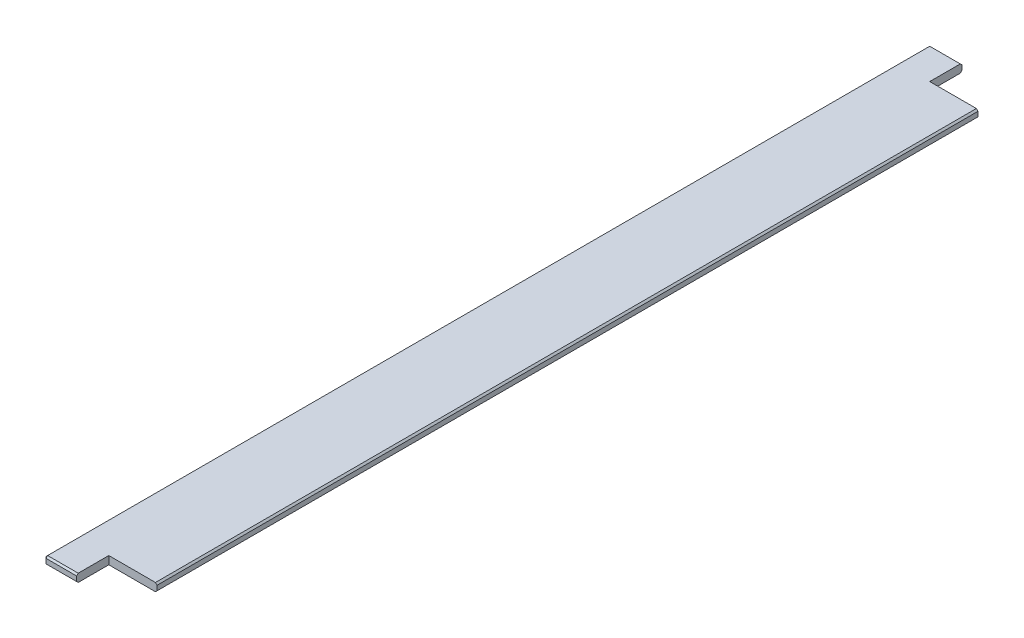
ISO-10303-21;
HEADER;
FILE_DESCRIPTION(('STEP AP214'),'2;1');
FILE_NAME('part.step','',(''),(''),'','','');
FILE_SCHEMA(('AUTOMOTIVE_DESIGN { 1 0 10303 214 1 1 1 1 }'));
ENDSEC;
DATA;
#1=APPLICATION_CONTEXT('core data for automotive mechanical design processes');
#2=APPLICATION_PROTOCOL_DEFINITION('international standard','automotive_design',2000,#1);
#3=PRODUCT_CONTEXT('',#1,'mechanical');
#4=PRODUCT('Part','Part','',(#3));
#5=PRODUCT_RELATED_PRODUCT_CATEGORY('part','',(#4));
#6=PRODUCT_DEFINITION_FORMATION('','',#4);
#7=PRODUCT_DEFINITION_CONTEXT('part definition',#1,'design');
#8=PRODUCT_DEFINITION('design','',#6,#7);
#9=PRODUCT_DEFINITION_SHAPE('','',#8);
#10=(LENGTH_UNIT() NAMED_UNIT(*) SI_UNIT(.MILLI.,.METRE.));
#11=(NAMED_UNIT(*) PLANE_ANGLE_UNIT() SI_UNIT($,.RADIAN.));
#12=(NAMED_UNIT(*) SI_UNIT($,.STERADIAN.) SOLID_ANGLE_UNIT());
#13=UNCERTAINTY_MEASURE_WITH_UNIT(LENGTH_MEASURE(1.E-05),#10,'distance_accuracy_value','');
#14=(GEOMETRIC_REPRESENTATION_CONTEXT(3) GLOBAL_UNCERTAINTY_ASSIGNED_CONTEXT((#13)) GLOBAL_UNIT_ASSIGNED_CONTEXT((#10,
#11,#12)) REPRESENTATION_CONTEXT('',''));
#15=CARTESIAN_POINT('',(0.,0.,0.));
#16=DIRECTION('',(0.,0.,1.));
#17=DIRECTION('',(1.,0.,0.));
#18=AXIS2_PLACEMENT_3D('',#15,#16,#17);
#19=CARTESIAN_POINT('',(50.,-4.99999999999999,550.));
#20=DIRECTION('',(-1.,0.,0.));
#21=DIRECTION('',(0.,0.,1.));
#22=AXIS2_PLACEMENT_3D('',#19,#20,#21);
#23=PLANE('',#22);
#24=DIRECTION('',(0.,0.,-1.));
#25=VECTOR('',#24,1.);
#26=CARTESIAN_POINT('',(50.,-2.99999999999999,550.));
#27=LINE('',#26,#25);
#28=CARTESIAN_POINT('',(50.,-2.99999999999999,510.));
#29=VERTEX_POINT('',#28);
#30=CARTESIAN_POINT('',(50.,-2.99999999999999,-510.));
#31=VERTEX_POINT('',#30);
#32=EDGE_CURVE('E216',#29,#31,#27,.T.);
#33=ORIENTED_EDGE('',*,*,#32,.T.);
#34=DIRECTION('',(0.,1.,0.));
#35=VECTOR('',#34,1.);
#36=CARTESIAN_POINT('',(50.,-5.00000000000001,-510.));
#37=LINE('',#36,#35);
#38=CARTESIAN_POINT('',(50.,2.9999999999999,-510.));
#39=VERTEX_POINT('',#38);
#40=EDGE_CURVE('E149',#31,#39,#37,.T.);
#41=ORIENTED_EDGE('',*,*,#40,.T.);
#42=DIRECTION('',(0.,0.,1.));
#43=VECTOR('',#42,1.);
#44=CARTESIAN_POINT('',(50.,2.9999999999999,550.));
#45=LINE('',#44,#43);
#46=CARTESIAN_POINT('',(50.,2.9999999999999,510.));
#47=VERTEX_POINT('',#46);
#48=EDGE_CURVE('E214',#39,#47,#45,.T.);
#49=ORIENTED_EDGE('',*,*,#48,.T.);
#50=DIRECTION('',(0.,1.,0.));
#51=VECTOR('',#50,1.);
#52=CARTESIAN_POINT('',(50.,-5.00000000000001,510.));
#53=LINE('',#52,#51);
#54=EDGE_CURVE('E180',#29,#47,#53,.T.);
#55=ORIENTED_EDGE('',*,*,#54,.F.);
#56=EDGE_LOOP('',(#33,#41,#49,#55));
#57=FACE_BOUND('',#56,.T.);
#58=ADVANCED_FACE('F30',(#57),#23,.F.);
#59=CARTESIAN_POINT('',(50.,5.00000000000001,550.));
#60=DIRECTION('',(0.,-1.,0.));
#61=DIRECTION('',(1.,0.,0.));
#62=AXIS2_PLACEMENT_3D('',#59,#60,#61);
#63=PLANE('',#62);
#64=DIRECTION('',(0.,0.,-1.));
#65=VECTOR('',#64,1.);
#66=CARTESIAN_POINT('',(48.,5.00000000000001,550.));
#67=LINE('',#66,#65);
#68=CARTESIAN_POINT('',(48.,5.00000000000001,510.));
#69=VERTEX_POINT('',#68);
#70=CARTESIAN_POINT('',(48.,5.00000000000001,-510.));
#71=VERTEX_POINT('',#70);
#72=EDGE_CURVE('E239',#69,#71,#67,.T.);
#73=ORIENTED_EDGE('',*,*,#72,.T.);
#74=DIRECTION('',(1.,0.,0.));
#75=VECTOR('',#74,1.);
#76=CARTESIAN_POINT('',(50.,5.00000000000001,-510.));
#77=LINE('',#76,#75);
#78=CARTESIAN_POINT('',(-9.99999999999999,5.,-510.));
#79=VERTEX_POINT('',#78);
#80=EDGE_CURVE('E161',#79,#71,#77,.T.);
#81=ORIENTED_EDGE('',*,*,#80,.F.);
#82=DIRECTION('',(0.,0.,1.));
#83=VECTOR('',#82,1.);
#84=CARTESIAN_POINT('',(-9.99999999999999,5.,-510.));
#85=LINE('',#84,#83);
#86=CARTESIAN_POINT('',(-9.99999999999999,5.,-548.));
#87=VERTEX_POINT('',#86);
#88=EDGE_CURVE('E146',#87,#79,#85,.T.);
#89=ORIENTED_EDGE('',*,*,#88,.F.);
#90=DIRECTION('',(-1.,0.,0.));
#91=VECTOR('',#90,1.);
#92=CARTESIAN_POINT('',(50.,5.00000000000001,-548.));
#93=LINE('',#92,#91);
#94=CARTESIAN_POINT('',(-48.,4.99999999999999,-548.));
#95=VERTEX_POINT('',#94);
#96=EDGE_CURVE('E232',#87,#95,#93,.T.);
#97=ORIENTED_EDGE('',*,*,#96,.T.);
#98=DIRECTION('',(0.,0.,1.));
#99=VECTOR('',#98,1.);
#100=CARTESIAN_POINT('',(-48.,4.99999999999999,550.));
#101=LINE('',#100,#99);
#102=CARTESIAN_POINT('',(-48.,4.99999999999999,548.));
#103=VERTEX_POINT('',#102);
#104=EDGE_CURVE('E234',#95,#103,#101,.T.);
#105=ORIENTED_EDGE('',*,*,#104,.T.);
#106=DIRECTION('',(1.,0.,0.));
#107=VECTOR('',#106,1.);
#108=CARTESIAN_POINT('',(50.,5.00000000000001,548.));
#109=LINE('',#108,#107);
#110=CARTESIAN_POINT('',(-9.99999999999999,5.,548.));
#111=VERTEX_POINT('',#110);
#112=EDGE_CURVE('E236',#103,#111,#109,.T.);
#113=ORIENTED_EDGE('',*,*,#112,.T.);
#114=DIRECTION('',(0.,0.,1.));
#115=VECTOR('',#114,1.);
#116=CARTESIAN_POINT('',(-9.99999999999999,5.,510.));
#117=LINE('',#116,#115);
#118=CARTESIAN_POINT('',(-9.99999999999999,5.,510.));
#119=VERTEX_POINT('',#118);
#120=EDGE_CURVE('E177',#119,#111,#117,.T.);
#121=ORIENTED_EDGE('',*,*,#120,.F.);
#122=DIRECTION('',(-1.,0.,0.));
#123=VECTOR('',#122,1.);
#124=CARTESIAN_POINT('',(50.,5.00000000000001,510.));
#125=LINE('',#124,#123);
#126=EDGE_CURVE('E173',#69,#119,#125,.T.);
#127=ORIENTED_EDGE('',*,*,#126,.F.);
#128=EDGE_LOOP('',(#73,#81,#89,#97,#105,#113,#121,#127));
#129=FACE_BOUND('',#128,.T.);
#130=ADVANCED_FACE('F315',(#129),#63,.F.);
#131=CARTESIAN_POINT('',(-50.,-5.00000000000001,550.));
#132=DIRECTION('',(1.,0.,0.));
#133=DIRECTION('',(0.,0.,-1.));
#134=AXIS2_PLACEMENT_3D('',#131,#132,#133);
#135=PLANE('',#134);
#136=DIRECTION('',(0.,0.,-1.));
#137=VECTOR('',#136,1.);
#138=CARTESIAN_POINT('',(-50.,2.99999999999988,550.));
#139=LINE('',#138,#137);
#140=CARTESIAN_POINT('',(-50.,2.99999999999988,548.));
#141=VERTEX_POINT('',#140);
#142=CARTESIAN_POINT('',(-50.,2.99999999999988,-548.));
#143=VERTEX_POINT('',#142);
#144=EDGE_CURVE('E196',#141,#143,#139,.T.);
#145=ORIENTED_EDGE('',*,*,#144,.T.);
#146=DIRECTION('',(0.,-1.,0.));
#147=VECTOR('',#146,1.);
#148=CARTESIAN_POINT('',(-50.,-5.00000000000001,-548.));
#149=LINE('',#148,#147);
#150=CARTESIAN_POINT('',(-50.,-2.99999999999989,-548.));
#151=VERTEX_POINT('',#150);
#152=EDGE_CURVE('E203',#143,#151,#149,.T.);
#153=ORIENTED_EDGE('',*,*,#152,.T.);
#154=DIRECTION('',(0.,0.,1.));
#155=VECTOR('',#154,1.);
#156=CARTESIAN_POINT('',(-50.,-2.99999999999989,550.));
#157=LINE('',#156,#155);
#158=CARTESIAN_POINT('',(-50.,-2.99999999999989,548.));
#159=VERTEX_POINT('',#158);
#160=EDGE_CURVE('E201',#151,#159,#157,.T.);
#161=ORIENTED_EDGE('',*,*,#160,.T.);
#162=DIRECTION('',(0.,1.,0.));
#163=VECTOR('',#162,1.);
#164=CARTESIAN_POINT('',(-50.,4.99999999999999,548.));
#165=LINE('',#164,#163);
#166=EDGE_CURVE('E198',#159,#141,#165,.T.);
#167=ORIENTED_EDGE('',*,*,#166,.T.);
#168=EDGE_LOOP('',(#145,#153,#161,#167));
#169=FACE_BOUND('',#168,.T.);
#170=ADVANCED_FACE('F301',(#169),#135,.F.);
#171=CARTESIAN_POINT('',(50.,-4.99999999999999,550.));
#172=DIRECTION('',(0.,1.,0.));
#173=DIRECTION('',(-1.,0.,0.));
#174=AXIS2_PLACEMENT_3D('',#171,#172,#173);
#175=PLANE('',#174);
#176=DIRECTION('',(0.,0.,1.));
#177=VECTOR('',#176,1.);
#178=CARTESIAN_POINT('',(-9.99999999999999,-5.00000000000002,-510.));
#179=LINE('',#178,#177);
#180=CARTESIAN_POINT('',(-9.99999999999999,-5.,-548.));
#181=VERTEX_POINT('',#180);
#182=CARTESIAN_POINT('',(-9.99999999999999,-5.00000000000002,-510.));
#183=VERTEX_POINT('',#182);
#184=EDGE_CURVE('E45',#181,#183,#179,.T.);
#185=ORIENTED_EDGE('',*,*,#184,.T.);
#186=DIRECTION('',(1.,0.,0.));
#187=VECTOR('',#186,1.);
#188=CARTESIAN_POINT('',(50.,-5.00000000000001,-510.));
#189=LINE('',#188,#187);
#190=CARTESIAN_POINT('',(47.9999999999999,-5.00000000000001,-510.));
#191=VERTEX_POINT('',#190);
#192=EDGE_CURVE('E152',#183,#191,#189,.T.);
#193=ORIENTED_EDGE('',*,*,#192,.T.);
#194=DIRECTION('',(0.,0.,1.));
#195=VECTOR('',#194,1.);
#196=CARTESIAN_POINT('',(47.9999999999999,-4.99999999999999,550.));
#197=LINE('',#196,#195);
#198=CARTESIAN_POINT('',(47.9999999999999,-4.99999999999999,510.));
#199=VERTEX_POINT('',#198);
#200=EDGE_CURVE('E53',#191,#199,#197,.T.);
#201=ORIENTED_EDGE('',*,*,#200,.T.);
#202=DIRECTION('',(-1.,0.,0.));
#203=VECTOR('',#202,1.);
#204=CARTESIAN_POINT('',(50.,-5.00000000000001,510.));
#205=LINE('',#204,#203);
#206=CARTESIAN_POINT('',(-9.99999999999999,-5.00000000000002,510.));
#207=VERTEX_POINT('',#206);
#208=EDGE_CURVE('E174',#199,#207,#205,.T.);
#209=ORIENTED_EDGE('',*,*,#208,.T.);
#210=DIRECTION('',(0.,0.,1.));
#211=VECTOR('',#210,1.);
#212=CARTESIAN_POINT('',(-9.99999999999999,-5.00000000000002,510.));
#213=LINE('',#212,#211);
#214=CARTESIAN_POINT('',(-9.99999999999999,-5.00000000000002,548.));
#215=VERTEX_POINT('',#214);
#216=EDGE_CURVE('E176',#207,#215,#213,.T.);
#217=ORIENTED_EDGE('',*,*,#216,.T.);
#218=DIRECTION('',(-1.,0.,0.));
#219=VECTOR('',#218,1.);
#220=CARTESIAN_POINT('',(-50.,-5.00000000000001,548.));
#221=LINE('',#220,#219);
#222=CARTESIAN_POINT('',(-48.,-5.00000000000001,548.));
#223=VERTEX_POINT('',#222);
#224=EDGE_CURVE('E219',#215,#223,#221,.T.);
#225=ORIENTED_EDGE('',*,*,#224,.T.);
#226=DIRECTION('',(0.,0.,-1.));
#227=VECTOR('',#226,1.);
#228=CARTESIAN_POINT('',(-48.,-5.00000000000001,550.));
#229=LINE('',#228,#227);
#230=CARTESIAN_POINT('',(-48.,-5.00000000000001,-548.));
#231=VERTEX_POINT('',#230);
#232=EDGE_CURVE('E223',#223,#231,#229,.T.);
#233=ORIENTED_EDGE('',*,*,#232,.T.);
#234=DIRECTION('',(1.,0.,0.));
#235=VECTOR('',#234,1.);
#236=CARTESIAN_POINT('',(50.,-4.99999999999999,-548.));
#237=LINE('',#236,#235);
#238=EDGE_CURVE('E160',#231,#181,#237,.T.);
#239=ORIENTED_EDGE('',*,*,#238,.T.);
#240=EDGE_LOOP('',(#185,#193,#201,#209,#217,#225,#233,#239));
#241=FACE_BOUND('',#240,.T.);
#242=ADVANCED_FACE('F157',(#241),#175,.F.);
#243=CARTESIAN_POINT('',(50.,5.00000000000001,550.));
#244=DIRECTION('',(0.,0.,1.));
#245=DIRECTION('',(1.,0.,0.));
#246=AXIS2_PLACEMENT_3D('',#243,#244,#245);
#247=PLANE('',#246);
#248=DIRECTION('',(0.,1.,0.));
#249=VECTOR('',#248,1.);
#250=CARTESIAN_POINT('',(-9.99999999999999,-5.00000000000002,550.));
#251=LINE('',#250,#249);
#252=CARTESIAN_POINT('',(-9.99999999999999,-2.99999999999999,550.));
#253=VERTEX_POINT('',#252);
#254=CARTESIAN_POINT('',(-9.99999999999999,2.99999999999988,550.));
#255=VERTEX_POINT('',#254);
#256=EDGE_CURVE('E183',#253,#255,#251,.T.);
#257=ORIENTED_EDGE('',*,*,#256,.T.);
#258=DIRECTION('',(-1.,0.,0.));
#259=VECTOR('',#258,1.);
#260=CARTESIAN_POINT('',(-50.,2.99999999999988,550.));
#261=LINE('',#260,#259);
#262=CARTESIAN_POINT('',(-48.,2.99999999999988,550.));
#263=VERTEX_POINT('',#262);
#264=EDGE_CURVE('E225',#255,#263,#261,.T.);
#265=ORIENTED_EDGE('',*,*,#264,.T.);
#266=DIRECTION('',(0.,-1.,0.));
#267=VECTOR('',#266,1.);
#268=CARTESIAN_POINT('',(-48.,-5.00000000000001,550.));
#269=LINE('',#268,#267);
#270=CARTESIAN_POINT('',(-48.,-3.,550.));
#271=VERTEX_POINT('',#270);
#272=EDGE_CURVE('E227',#263,#271,#269,.T.);
#273=ORIENTED_EDGE('',*,*,#272,.T.);
#274=DIRECTION('',(1.,0.,0.));
#275=VECTOR('',#274,1.);
#276=CARTESIAN_POINT('',(50.,-2.99999999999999,550.));
#277=LINE('',#276,#275);
#278=EDGE_CURVE('E229',#271,#253,#277,.T.);
#279=ORIENTED_EDGE('',*,*,#278,.T.);
#280=EDGE_LOOP('',(#257,#265,#273,#279));
#281=FACE_BOUND('',#280,.T.);
#282=ADVANCED_FACE('F389',(#281),#247,.T.);
#283=CARTESIAN_POINT('',(50.,5.00000000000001,-550.));
#284=DIRECTION('',(0.,0.,1.));
#285=DIRECTION('',(1.,0.,0.));
#286=AXIS2_PLACEMENT_3D('',#283,#284,#285);
#287=PLANE('',#286);
#288=DIRECTION('',(1.,0.,0.));
#289=VECTOR('',#288,1.);
#290=CARTESIAN_POINT('',(50.,2.99999999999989,-550.));
#291=LINE('',#290,#289);
#292=CARTESIAN_POINT('',(-47.9999999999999,2.99999999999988,-550.));
#293=VERTEX_POINT('',#292);
#294=CARTESIAN_POINT('',(-9.99999999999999,2.99999999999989,-550.));
#295=VERTEX_POINT('',#294);
#296=EDGE_CURVE('E206',#293,#295,#291,.T.);
#297=ORIENTED_EDGE('',*,*,#296,.T.);
#298=DIRECTION('',(0.,1.,0.));
#299=VECTOR('',#298,1.);
#300=CARTESIAN_POINT('',(-9.99999999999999,-5.00000000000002,-550.));
#301=LINE('',#300,#299);
#302=CARTESIAN_POINT('',(-9.99999999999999,-2.99999999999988,-550.));
#303=VERTEX_POINT('',#302);
#304=EDGE_CURVE('E150',#303,#295,#301,.T.);
#305=ORIENTED_EDGE('',*,*,#304,.F.);
#306=DIRECTION('',(-1.,0.,0.));
#307=VECTOR('',#306,1.);
#308=CARTESIAN_POINT('',(50.,-2.99999999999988,-550.));
#309=LINE('',#308,#307);
#310=CARTESIAN_POINT('',(-47.9999999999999,-2.99999999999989,-550.));
#311=VERTEX_POINT('',#310);
#312=EDGE_CURVE('E212',#303,#311,#309,.T.);
#313=ORIENTED_EDGE('',*,*,#312,.T.);
#314=DIRECTION('',(0.,1.,0.));
#315=VECTOR('',#314,1.);
#316=CARTESIAN_POINT('',(-47.9999999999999,5.00000000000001,-550.));
#317=LINE('',#316,#315);
#318=EDGE_CURVE('E209',#311,#293,#317,.T.);
#319=ORIENTED_EDGE('',*,*,#318,.T.);
#320=EDGE_LOOP('',(#297,#305,#313,#319));
#321=FACE_BOUND('',#320,.T.);
#322=ADVANCED_FACE('F281',(#321),#287,.F.);
#323=CARTESIAN_POINT('',(48.,5.00000000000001,550.));
#324=DIRECTION('',(-0.707106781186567,-0.707106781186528,0.));
#325=DIRECTION('',(0.707106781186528,-0.707106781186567,0.));
#326=AXIS2_PLACEMENT_3D('',#323,#324,#325);
#327=PLANE('',#326);
#328=DIRECTION('',(-0.707106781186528,0.707106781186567,0.));
#329=VECTOR('',#328,1.);
#330=CARTESIAN_POINT('',(48.,5.00000000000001,-510.));
#331=LINE('',#330,#329);
#332=EDGE_CURVE('E171',#71,#39,#331,.F.);
#333=ORIENTED_EDGE('',*,*,#332,.F.);
#334=ORIENTED_EDGE('',*,*,#72,.F.);
#335=DIRECTION('',(0.707106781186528,-0.707106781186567,0.));
#336=VECTOR('',#335,1.);
#337=CARTESIAN_POINT('',(48.,5.00000000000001,510.));
#338=LINE('',#337,#336);
#339=EDGE_CURVE('E186',#47,#69,#338,.F.);
#340=ORIENTED_EDGE('',*,*,#339,.F.);
#341=ORIENTED_EDGE('',*,*,#48,.F.);
#342=EDGE_LOOP('',(#333,#334,#340,#341));
#343=FACE_BOUND('',#342,.T.);
#344=ADVANCED_FACE('F32',(#343),#327,.F.);
#345=CARTESIAN_POINT('',(50.,2.9999999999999,550.));
#346=DIRECTION('',(0.,0.707106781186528,0.707106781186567));
#347=DIRECTION('',(0.,-0.707106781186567,0.707106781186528));
#348=AXIS2_PLACEMENT_3D('',#345,#346,#347);
#349=PLANE('',#348);
#350=DIRECTION('',(0.,-0.707106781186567,0.707106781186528));
#351=VECTOR('',#350,1.);
#352=CARTESIAN_POINT('',(-9.99999999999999,2.99999999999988,550.));
#353=LINE('',#352,#351);
#354=EDGE_CURVE('E193',#111,#255,#353,.T.);
#355=ORIENTED_EDGE('',*,*,#354,.F.);
#356=ORIENTED_EDGE('',*,*,#112,.F.);
#357=DIRECTION('',(0.,0.707106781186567,-0.707106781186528));
#358=VECTOR('',#357,1.);
#359=CARTESIAN_POINT('',(-48.,3.99999999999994,549.));
#360=LINE('',#359,#358);
#361=EDGE_CURVE('E199',#263,#103,#360,.T.);
#362=ORIENTED_EDGE('',*,*,#361,.F.);
#363=ORIENTED_EDGE('',*,*,#264,.F.);
#364=EDGE_LOOP('',(#355,#356,#362,#363));
#365=FACE_BOUND('',#364,.T.);
#366=ADVANCED_FACE('F385',(#365),#349,.T.);
#367=CARTESIAN_POINT('',(-48.,5.00000000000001,550.));
#368=DIRECTION('',(-0.707106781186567,0.,0.707106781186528));
#369=DIRECTION('',(0.707106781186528,0.,0.707106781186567));
#370=AXIS2_PLACEMENT_3D('',#367,#368,#369);
#371=PLANE('',#370);
#372=DIRECTION('',(-0.707106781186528,0.,-0.707106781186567));
#373=VECTOR('',#372,1.);
#374=CARTESIAN_POINT('',(-50.,-2.99999999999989,548.));
#375=LINE('',#374,#373);
#376=EDGE_CURVE('E266',#271,#159,#375,.T.);
#377=ORIENTED_EDGE('',*,*,#376,.F.);
#378=ORIENTED_EDGE('',*,*,#272,.F.);
#379=DIRECTION('',(0.707106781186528,0.,0.707106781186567));
#380=VECTOR('',#379,1.);
#381=CARTESIAN_POINT('',(-50.,2.99999999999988,548.));
#382=LINE('',#381,#380);
#383=EDGE_CURVE('E269',#141,#263,#382,.T.);
#384=ORIENTED_EDGE('',*,*,#383,.F.);
#385=ORIENTED_EDGE('',*,*,#166,.F.);
#386=EDGE_LOOP('',(#377,#378,#384,#385));
#387=FACE_BOUND('',#386,.T.);
#388=ADVANCED_FACE('F341',(#387),#371,.T.);
#389=CARTESIAN_POINT('',(50.,-2.99999999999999,550.));
#390=DIRECTION('',(0.,-0.707106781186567,0.707106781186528));
#391=DIRECTION('',(0.,-0.707106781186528,-0.707106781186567));
#392=AXIS2_PLACEMENT_3D('',#389,#390,#391);
#393=PLANE('',#392);
#394=DIRECTION('',(0.,-0.707106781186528,-0.707106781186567));
#395=VECTOR('',#394,1.);
#396=CARTESIAN_POINT('',(-9.99999999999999,-2.99999999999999,550.));
#397=LINE('',#396,#395);
#398=EDGE_CURVE('E275',#253,#215,#397,.T.);
#399=ORIENTED_EDGE('',*,*,#398,.F.);
#400=ORIENTED_EDGE('',*,*,#278,.F.);
#401=DIRECTION('',(0.,0.707106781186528,0.707106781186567));
#402=VECTOR('',#401,1.);
#403=CARTESIAN_POINT('',(-48.,-4.00000000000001,549.));
#404=LINE('',#403,#402);
#405=EDGE_CURVE('E263',#223,#271,#404,.T.);
#406=ORIENTED_EDGE('',*,*,#405,.F.);
#407=ORIENTED_EDGE('',*,*,#224,.F.);
#408=EDGE_LOOP('',(#399,#400,#406,#407));
#409=FACE_BOUND('',#408,.T.);
#410=ADVANCED_FACE('F332',(#409),#393,.T.);
#411=CARTESIAN_POINT('',(50.,-2.99999999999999,550.));
#412=DIRECTION('',(-0.707106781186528,0.707106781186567,0.));
#413=DIRECTION('',(-0.707106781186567,-0.707106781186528,0.));
#414=AXIS2_PLACEMENT_3D('',#411,#412,#413);
#415=PLANE('',#414);
#416=DIRECTION('',(0.707106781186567,0.707106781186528,0.));
#417=VECTOR('',#416,1.);
#418=CARTESIAN_POINT('',(50.,-2.99999999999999,-510.));
#419=LINE('',#418,#417);
#420=EDGE_CURVE('E11',#31,#191,#419,.F.);
#421=ORIENTED_EDGE('',*,*,#420,.F.);
#422=ORIENTED_EDGE('',*,*,#32,.F.);
#423=DIRECTION('',(-0.707106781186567,-0.707106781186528,0.));
#424=VECTOR('',#423,1.);
#425=CARTESIAN_POINT('',(50.,-2.99999999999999,510.));
#426=LINE('',#425,#424);
#427=EDGE_CURVE('E242',#199,#29,#426,.F.);
#428=ORIENTED_EDGE('',*,*,#427,.F.);
#429=ORIENTED_EDGE('',*,*,#200,.F.);
#430=EDGE_LOOP('',(#421,#422,#428,#429));
#431=FACE_BOUND('',#430,.T.);
#432=ADVANCED_FACE('F329',(#431),#415,.F.);
#433=CARTESIAN_POINT('',(-50.,2.99999999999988,548.));
#434=DIRECTION('',(-0.577350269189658,0.577350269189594,0.577350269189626));
#435=DIRECTION('',(0.707106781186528,0.,0.707106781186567));
#436=AXIS2_PLACEMENT_3D('',#433,#434,#435);
#437=PLANE('',#436);
#438=ORIENTED_EDGE('',*,*,#383,.T.);
#439=ORIENTED_EDGE('',*,*,#361,.T.);
#440=DIRECTION('',(0.707106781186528,0.707106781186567,0.));
#441=VECTOR('',#440,1.);
#442=CARTESIAN_POINT('',(-50.,2.99999999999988,548.));
#443=LINE('',#442,#441);
#444=EDGE_CURVE('E260',#141,#103,#443,.T.);
#445=ORIENTED_EDGE('',*,*,#444,.F.);
#446=EDGE_LOOP('',(#438,#439,#445));
#447=FACE_BOUND('',#446,.T.);
#448=ADVANCED_FACE('F331',(#447),#437,.T.);
#449=CARTESIAN_POINT('',(-50.,-2.99999999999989,548.));
#450=DIRECTION('',(-0.577350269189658,-0.577350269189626,0.577350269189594));
#451=DIRECTION('',(0.707106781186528,-0.707106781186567,0.));
#452=AXIS2_PLACEMENT_3D('',#449,#450,#451);
#453=PLANE('',#452);
#454=ORIENTED_EDGE('',*,*,#405,.T.);
#455=ORIENTED_EDGE('',*,*,#376,.T.);
#456=DIRECTION('',(-0.707106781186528,0.707106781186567,0.));
#457=VECTOR('',#456,1.);
#458=CARTESIAN_POINT('',(-50.,-2.99999999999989,548.));
#459=LINE('',#458,#457);
#460=EDGE_CURVE('E257',#223,#159,#459,.T.);
#461=ORIENTED_EDGE('',*,*,#460,.F.);
#462=EDGE_LOOP('',(#454,#455,#461));
#463=FACE_BOUND('',#462,.T.);
#464=ADVANCED_FACE('F338',(#463),#453,.T.);
#465=CARTESIAN_POINT('',(50.,5.00000000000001,-548.));
#466=DIRECTION('',(0.,-0.707106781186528,0.707106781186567));
#467=DIRECTION('',(0.,-0.707106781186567,-0.707106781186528));
#468=AXIS2_PLACEMENT_3D('',#465,#466,#467);
#469=PLANE('',#468);
#470=DIRECTION('',(0.,-0.707106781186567,-0.707106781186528));
#471=VECTOR('',#470,1.);
#472=CARTESIAN_POINT('',(-9.99999999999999,5.,-548.));
#473=LINE('',#472,#471);
#474=EDGE_CURVE('E167',#295,#87,#473,.F.);
#475=ORIENTED_EDGE('',*,*,#474,.F.);
#476=ORIENTED_EDGE('',*,*,#296,.F.);
#477=DIRECTION('',(0.,0.707106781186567,0.707106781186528));
#478=VECTOR('',#477,1.);
#479=CARTESIAN_POINT('',(-47.9999999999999,2.99999999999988,-550.));
#480=LINE('',#479,#478);
#481=EDGE_CURVE('E254',#95,#293,#480,.F.);
#482=ORIENTED_EDGE('',*,*,#481,.F.);
#483=ORIENTED_EDGE('',*,*,#96,.F.);
#484=EDGE_LOOP('',(#475,#476,#482,#483));
#485=FACE_BOUND('',#484,.T.);
#486=ADVANCED_FACE('F313',(#485),#469,.F.);
#487=CARTESIAN_POINT('',(-50.,2.99999999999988,550.));
#488=DIRECTION('',(0.707106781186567,-0.707106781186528,0.));
#489=DIRECTION('',(0.707106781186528,0.707106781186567,0.));
#490=AXIS2_PLACEMENT_3D('',#487,#488,#489);
#491=PLANE('',#490);
#492=ORIENTED_EDGE('',*,*,#444,.T.);
#493=ORIENTED_EDGE('',*,*,#104,.F.);
#494=DIRECTION('',(-0.707106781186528,-0.707106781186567,0.));
#495=VECTOR('',#494,1.);
#496=CARTESIAN_POINT('',(-49.,3.99999999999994,-548.));
#497=LINE('',#496,#495);
#498=EDGE_CURVE('E251',#143,#95,#497,.F.);
#499=ORIENTED_EDGE('',*,*,#498,.F.);
#500=ORIENTED_EDGE('',*,*,#144,.F.);
#501=EDGE_LOOP('',(#492,#493,#499,#500));
#502=FACE_BOUND('',#501,.T.);
#503=ADVANCED_FACE('F307',(#502),#491,.F.);
#504=CARTESIAN_POINT('',(-48.,-5.00000000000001,550.));
#505=DIRECTION('',(0.707106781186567,0.707106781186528,0.));
#506=DIRECTION('',(-0.707106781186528,0.707106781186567,0.));
#507=AXIS2_PLACEMENT_3D('',#504,#505,#506);
#508=PLANE('',#507);
#509=ORIENTED_EDGE('',*,*,#460,.T.);
#510=ORIENTED_EDGE('',*,*,#160,.F.);
#511=DIRECTION('',(0.707106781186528,-0.707106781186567,0.));
#512=VECTOR('',#511,1.);
#513=CARTESIAN_POINT('',(-50.,-2.99999999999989,-548.));
#514=LINE('',#513,#512);
#515=EDGE_CURVE('E248',#231,#151,#514,.F.);
#516=ORIENTED_EDGE('',*,*,#515,.F.);
#517=ORIENTED_EDGE('',*,*,#232,.F.);
#518=EDGE_LOOP('',(#509,#510,#516,#517));
#519=FACE_BOUND('',#518,.T.);
#520=ADVANCED_FACE('F297',(#519),#508,.F.);
#521=CARTESIAN_POINT('',(50.,-4.99999999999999,-548.));
#522=DIRECTION('',(0.,0.707106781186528,0.707106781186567));
#523=DIRECTION('',(0.,-0.707106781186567,0.707106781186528));
#524=AXIS2_PLACEMENT_3D('',#521,#522,#523);
#525=PLANE('',#524);
#526=DIRECTION('',(0.,-0.707106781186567,0.707106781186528));
#527=VECTOR('',#526,1.);
#528=CARTESIAN_POINT('',(-9.99999999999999,-5.,-548.));
#529=LINE('',#528,#527);
#530=EDGE_CURVE('E38',#181,#303,#529,.F.);
#531=ORIENTED_EDGE('',*,*,#530,.F.);
#532=ORIENTED_EDGE('',*,*,#238,.F.);
#533=DIRECTION('',(0.,0.707106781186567,-0.707106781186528));
#534=VECTOR('',#533,1.);
#535=CARTESIAN_POINT('',(-47.9999999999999,-3.99999999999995,-549.));
#536=LINE('',#535,#534);
#537=EDGE_CURVE('E246',#311,#231,#536,.F.);
#538=ORIENTED_EDGE('',*,*,#537,.F.);
#539=ORIENTED_EDGE('',*,*,#312,.F.);
#540=EDGE_LOOP('',(#531,#532,#538,#539));
#541=FACE_BOUND('',#540,.T.);
#542=ADVANCED_FACE('F284',(#541),#525,.F.);
#543=CARTESIAN_POINT('',(-47.9999999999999,2.99999999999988,-550.));
#544=DIRECTION('',(-0.577350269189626,0.577350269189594,-0.577350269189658));
#545=DIRECTION('',(-0.707106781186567,0.,0.707106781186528));
#546=AXIS2_PLACEMENT_3D('',#543,#544,#545);
#547=PLANE('',#546);
#548=ORIENTED_EDGE('',*,*,#498,.T.);
#549=ORIENTED_EDGE('',*,*,#481,.T.);
#550=DIRECTION('',(0.707106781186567,0.,-0.707106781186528));
#551=VECTOR('',#550,1.);
#552=CARTESIAN_POINT('',(-47.9999999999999,2.99999999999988,-550.));
#553=LINE('',#552,#551);
#554=EDGE_CURVE('E244',#143,#293,#553,.T.);
#555=ORIENTED_EDGE('',*,*,#554,.F.);
#556=EDGE_LOOP('',(#548,#549,#555));
#557=FACE_BOUND('',#556,.T.);
#558=ADVANCED_FACE('F310',(#557),#547,.T.);
#559=CARTESIAN_POINT('',(-50.,-2.99999999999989,-548.));
#560=DIRECTION('',(-0.577350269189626,-0.577350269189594,-0.577350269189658));
#561=DIRECTION('',(-0.707106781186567,0.,0.707106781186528));
#562=AXIS2_PLACEMENT_3D('',#559,#560,#561);
#563=PLANE('',#562);
#564=ORIENTED_EDGE('',*,*,#537,.T.);
#565=ORIENTED_EDGE('',*,*,#515,.T.);
#566=DIRECTION('',(-0.707106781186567,0.,0.707106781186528));
#567=VECTOR('',#566,1.);
#568=CARTESIAN_POINT('',(-50.,-2.99999999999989,-548.));
#569=LINE('',#568,#567);
#570=EDGE_CURVE('E195',#311,#151,#569,.T.);
#571=ORIENTED_EDGE('',*,*,#570,.F.);
#572=EDGE_LOOP('',(#564,#565,#571));
#573=FACE_BOUND('',#572,.T.);
#574=ADVANCED_FACE('F293',(#573),#563,.T.);
#575=CARTESIAN_POINT('',(-50.,-5.00000000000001,-548.));
#576=DIRECTION('',(0.707106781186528,0.,0.707106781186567));
#577=DIRECTION('',(0.707106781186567,0.,-0.707106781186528));
#578=AXIS2_PLACEMENT_3D('',#575,#576,#577);
#579=PLANE('',#578);
#580=ORIENTED_EDGE('',*,*,#554,.T.);
#581=ORIENTED_EDGE('',*,*,#318,.F.);
#582=ORIENTED_EDGE('',*,*,#570,.T.);
#583=ORIENTED_EDGE('',*,*,#152,.F.);
#584=EDGE_LOOP('',(#580,#581,#582,#583));
#585=FACE_BOUND('',#584,.T.);
#586=ADVANCED_FACE('F290',(#585),#579,.F.);
#587=CARTESIAN_POINT('',(-9.99999999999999,-5.00000000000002,510.));
#588=DIRECTION('',(-1.,0.,0.));
#589=DIRECTION('',(0.,0.,1.));
#590=AXIS2_PLACEMENT_3D('',#587,#588,#589);
#591=PLANE('',#590);
#592=ORIENTED_EDGE('',*,*,#354,.T.);
#593=ORIENTED_EDGE('',*,*,#256,.F.);
#594=ORIENTED_EDGE('',*,*,#398,.T.);
#595=ORIENTED_EDGE('',*,*,#216,.F.);
#596=DIRECTION('',(0.,1.,0.));
#597=VECTOR('',#596,1.);
#598=CARTESIAN_POINT('',(-9.99999999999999,-5.00000000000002,510.));
#599=LINE('',#598,#597);
#600=EDGE_CURVE('E187',#207,#119,#599,.T.);
#601=ORIENTED_EDGE('',*,*,#600,.T.);
#602=ORIENTED_EDGE('',*,*,#120,.T.);
#603=EDGE_LOOP('',(#592,#593,#594,#595,#601,#602));
#604=FACE_BOUND('',#603,.T.);
#605=ADVANCED_FACE('F354',(#604),#591,.F.);
#606=CARTESIAN_POINT('',(50.,-5.00000000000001,510.));
#607=DIRECTION('',(0.,0.,-1.));
#608=DIRECTION('',(-1.,0.,0.));
#609=AXIS2_PLACEMENT_3D('',#606,#607,#608);
#610=PLANE('',#609);
#611=ORIENTED_EDGE('',*,*,#339,.T.);
#612=ORIENTED_EDGE('',*,*,#126,.T.);
#613=ORIENTED_EDGE('',*,*,#600,.F.);
#614=ORIENTED_EDGE('',*,*,#208,.F.);
#615=ORIENTED_EDGE('',*,*,#427,.T.);
#616=ORIENTED_EDGE('',*,*,#54,.T.);
#617=EDGE_LOOP('',(#611,#612,#613,#614,#615,#616));
#618=FACE_BOUND('',#617,.T.);
#619=ADVANCED_FACE('F326',(#618),#610,.F.);
#620=CARTESIAN_POINT('',(50.,-5.00000000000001,-510.));
#621=DIRECTION('',(0.,0.,1.));
#622=DIRECTION('',(1.,0.,0.));
#623=AXIS2_PLACEMENT_3D('',#620,#621,#622);
#624=PLANE('',#623);
#625=ORIENTED_EDGE('',*,*,#332,.T.);
#626=ORIENTED_EDGE('',*,*,#40,.F.);
#627=ORIENTED_EDGE('',*,*,#420,.T.);
#628=ORIENTED_EDGE('',*,*,#192,.F.);
#629=DIRECTION('',(0.,1.,0.));
#630=VECTOR('',#629,1.);
#631=CARTESIAN_POINT('',(-9.99999999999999,-5.00000000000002,-510.));
#632=LINE('',#631,#630);
#633=EDGE_CURVE('E142',#183,#79,#632,.T.);
#634=ORIENTED_EDGE('',*,*,#633,.T.);
#635=ORIENTED_EDGE('',*,*,#80,.T.);
#636=EDGE_LOOP('',(#625,#626,#627,#628,#634,#635));
#637=FACE_BOUND('',#636,.T.);
#638=ADVANCED_FACE('F153',(#637),#624,.F.);
#639=CARTESIAN_POINT('',(-9.99999999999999,-5.00000000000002,-510.));
#640=DIRECTION('',(-1.,0.,0.));
#641=DIRECTION('',(0.,-1.,0.));
#642=AXIS2_PLACEMENT_3D('',#639,#640,#641);
#643=PLANE('',#642);
#644=ORIENTED_EDGE('',*,*,#474,.T.);
#645=ORIENTED_EDGE('',*,*,#88,.T.);
#646=ORIENTED_EDGE('',*,*,#633,.F.);
#647=ORIENTED_EDGE('',*,*,#184,.F.);
#648=ORIENTED_EDGE('',*,*,#530,.T.);
#649=ORIENTED_EDGE('',*,*,#304,.T.);
#650=EDGE_LOOP('',(#644,#645,#646,#647,#648,#649));
#651=FACE_BOUND('',#650,.T.);
#652=ADVANCED_FACE('F144',(#651),#643,.F.);
#653=CLOSED_SHELL('',(#58,#130,#170,#242,#282,#322,#344,#366,#388,#410,#432,#448,#464,#486,#503,
#520,#542,#558,#574,#586,#605,#619,#638,#652));
#654=MANIFOLD_SOLID_BREP('B2',#653);
#655=ADVANCED_BREP_SHAPE_REPRESENTATION('',(#18,#654),#14);
#656=SHAPE_DEFINITION_REPRESENTATION(#9,#655);
ENDSEC;
END-ISO-10303-21;
